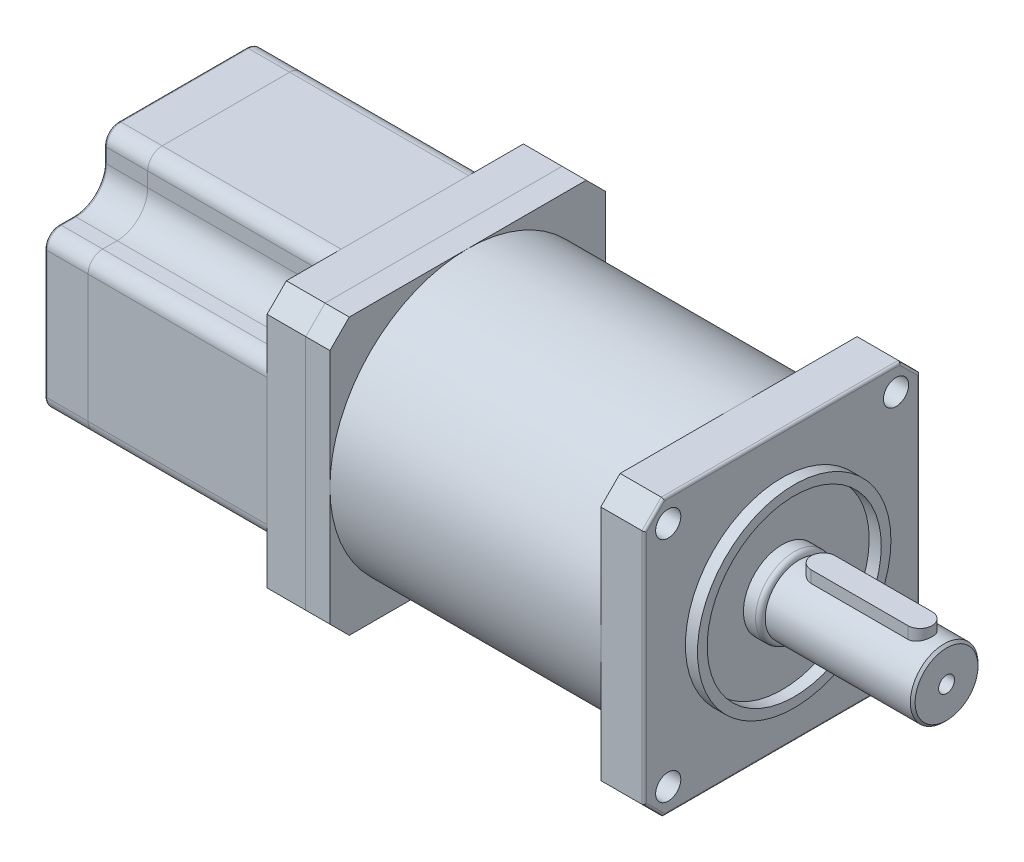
from build123d import *

# Parameters (mm, degrees)
EXTRUDE_1_DEPTH     = 9
SKETCH_2_R          = 28.5
EXTRUDE_2_DEPTH     = 56
EXTRUDE_3_DEPTH     = 5
EXTRUDE_4_DEPTH     = 8
EXTRUDE_5_DEPTH     = 37
EXTRUDE_6_DEPTH     = 9
CUT_EXTRUDE_1_DEPTH = 46
FILLET_1_R          = 0.5
FILLET_2_R          = 0.5
SKETCH_8_R          = 2.6
CUT_EXTRUDE_2_DEPTH = 9
SKETCH_9_R          = 20
SKETCH_9_R_2        = 18
EXTRUDE_7_DEPTH     = 2.5
SKETCH_10_R         = 8
EXTRUDE_8_DEPTH     = 3.5
FILLET_3_R          = 1
SKETCH_11_R         = 7
EXTRUDE_9_DEPTH     = 30.5
CUT_EXTRUDE_3_DEPTH = 3
EXTRUDE_10_DEPTH    = 5
CHAMFER_1_SIZE      = 0.5


with BuildPart() as part:
    # Sketch 1 → Extrude 1 (new body)
    with BuildSketch(Plane(origin=(0, 0, 0), x_dir=(0, 0, -1), z_dir=(1, 0, 0))):
        Polygon((-28.5, 24.5), (-24.5, 28.5), (24.5, 28.5), (28.5, 24.5), (28.5, -24.5), (24.5, -28.5), (-24.5, -28.5), (-28.5, -24.5), align=None)
    extrude(amount=-EXTRUDE_1_DEPTH)

    # Sketch 2 → Extrude 2 (add)
    with BuildSketch(Plane.ZY.offset(9)):
        Circle(SKETCH_2_R)
    extrude(amount=EXTRUDE_2_DEPTH)

    # Sketch 3 → Extrude 3 (add)
    with BuildSketch(Plane.ZY.offset(65)):
        Polygon((-24.5, -28.5), (24.5, -28.5), (28.5, -24.5), (28.5, 24.5), (24.5, 28.5), (-24.5, 28.5), (-28.5, 24.5), (-28.5, -24.5), align=None)
    extrude(amount=EXTRUDE_3_DEPTH)

    # Fillet 2
    fillet_2_edges = [part.edges().sort_by_distance(p)[0] for p in [
        (0, 26.5, 26.5),
        (0, 28.5, 0),
        (0, 26.5, -26.5),
        (0, 0, -28.5),
        (0, -26.5, -26.5),
        (0, -28.5, 0),
        (0, -26.5, 26.5),
        (0, 0, 28.5),
    ]]
    fillet(fillet_2_edges, radius=FILLET_2_R)

    # Sketch 8 → Cut-Extrude 2 (cut)
    with BuildSketch(Plane(origin=(0, 0, 0), x_dir=(0, 0, -1), z_dir=(1, 0, 0))):
        with Locations((-23.55, 23.55)):
            Circle(SKETCH_8_R)
        with Locations((23.55, 23.55)):
            Circle(SKETCH_8_R)
        with Locations((23.55, -23.55)):
            Circle(SKETCH_8_R)
        with Locations((-23.55, -23.55)):
            Circle(SKETCH_8_R)
    extrude(amount=-CUT_EXTRUDE_2_DEPTH, mode=Mode.SUBTRACT)

    # Sketch 9 → Extrude 7 (add)
    with BuildSketch(Plane(origin=(0, 0, 0), x_dir=(0, 0, -1), z_dir=(1, 0, 0))):
        Circle(SKETCH_9_R)
        Circle(SKETCH_9_R_2, mode=Mode.SUBTRACT)
    extrude(amount=EXTRUDE_7_DEPTH)

    # Sketch 10 → Extrude 8 (add)
    with BuildSketch(Plane(origin=(0, 0, 0), x_dir=(0, 0, -1), z_dir=(1, 0, 0))):
        Circle(SKETCH_10_R)
    extrude(amount=EXTRUDE_8_DEPTH)

    # Fillet 3
    fillet_3_edges = [part.edges().sort_by_distance(p)[0] for p in [
        (3.5, 0, 8),
    ]]
    fillet(fillet_3_edges, radius=FILLET_3_R)


with BuildPart() as body_2:
    # Sketch 4 → Extrude 4 (new body)
    with BuildSketch(Plane.ZY.offset(70)):
        Polygon((-24.5, -28.5), (24.5, -28.5), (28.5, -24.5), (28.5, 24.5), (24.5, 28.5), (-24.5, 28.5), (-28.5, 24.5), (-28.5, -24.5), align=None)
    extrude(amount=EXTRUDE_4_DEPTH)


with BuildPart() as body_3:
    # Sketch 5 → Extrude 5 (new body)
    with BuildSketch(Plane.ZY.offset(78)):
        Polygon((-24.5, -28.5), (24.5, -28.5), (28.5, -24.5), (28.5, 24.5), (24.5, 28.5), (-24.5, 28.5), (-28.5, 24.5), (-28.5, -24.5), align=None)
    extrude(amount=EXTRUDE_5_DEPTH)


with BuildPart() as body_4:
    # Sketch 6 → Extrude 6 (new body)
    with BuildSketch(Plane.ZY.offset(115)):
        Polygon((-24.5, -28.5), (24.5, -28.5), (28.5, -24.5), (28.5, 24.5), (24.5, 28.5), (-24.5, 28.5), (-28.5, 24.5), (-28.5, -24.5), align=None)
    extrude(amount=EXTRUDE_6_DEPTH)


with BuildPart() as cut_extrude_1_tool:
    # Sketch 7 → Cut-Extrude 1 (new body)
    with BuildSketch(Plane.ZY.offset(124)):
        with BuildLine():
            Line((-22.5, 16.17544468), (-25.5, 16.17544468))
            ThreePointArc((-25.5, 16.17544468), (-27.621320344, 15.296765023), (-28.5, 13.17544468))
            Line((-28.5, 13.17544468), (-28.5, 24.5))
            Line((-28.5, 24.5), (-24.5, 28.5))
            Line((-24.5, 28.5), (-13.17544468, 28.5))
            ThreePointArc((-13.17544468, 28.5), (-15.296765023, 27.621320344), (-16.17544468, 25.5))
            Line((-16.17544468, 25.5), (-16.17544468, 22.5))
            ThreePointArc((-16.17544468, 22.5), (-18.027864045, 18.027864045), (-22.5, 16.17544468))
        make_face()
        with BuildLine():
            Line((13.17544468, 28.5), (24.5, 28.5))
            Line((24.5, 28.5), (28.5, 24.5))
            Line((28.5, 24.5), (28.5, 13.17544468))
            ThreePointArc((28.5, 13.17544468), (27.621320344, 15.296765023), (25.5, 16.17544468))
            Line((25.5, 16.17544468), (22.5, 16.17544468))
            ThreePointArc((22.5, 16.17544468), (18.027864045, 18.027864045), (16.17544468, 22.5))
            Line((16.17544468, 22.5), (16.17544468, 25.5))
            ThreePointArc((16.17544468, 25.5), (15.296765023, 27.621320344), (13.17544468, 28.5))
        make_face()
        with BuildLine():
            Line((-25.5, -16.17544468), (-22.5, -16.17544468))
            ThreePointArc((-22.5, -16.17544468), (-18.027864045, -18.027864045), (-16.17544468, -22.5))
            Line((-16.17544468, -22.5), (-16.17544468, -25.5))
            ThreePointArc((-16.17544468, -25.5), (-15.296765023, -27.621320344), (-13.17544468, -28.5))
            Line((-13.17544468, -28.5), (-24.5, -28.5))
            Line((-24.5, -28.5), (-28.5, -24.5))
            Line((-28.5, -24.5), (-28.5, -13.17544468))
            ThreePointArc((-28.5, -13.17544468), (-27.621320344, -15.296765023), (-25.5, -16.17544468))
        make_face()
        with BuildLine():
            Line((28.5, -13.17544468), (28.5, -24.5))
            Line((28.5, -24.5), (24.5, -28.5))
            Line((24.5, -28.5), (13.17544468, -28.5))
            ThreePointArc((13.17544468, -28.5), (15.296765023, -27.621320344), (16.17544468, -25.5))
            Line((16.17544468, -25.5), (16.17544468, -22.5))
            ThreePointArc((16.17544468, -22.5), (18.027864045, -18.027864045), (22.5, -16.17544468))
            Line((22.5, -16.17544468), (25.5, -16.17544468))
            ThreePointArc((25.5, -16.17544468), (27.621320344, -15.296765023), (28.5, -13.17544468))
        make_face()
    extrude(amount=-CUT_EXTRUDE_1_DEPTH)


with BuildPart() as body_3_1:
    add(body_3.part)

    # Cut-Extrude 1: cut by cut_extrude_1_tool
    add(cut_extrude_1_tool.part, mode=Mode.SUBTRACT)


with BuildPart() as body_4_1:
    add(body_4.part)

    # Cut-Extrude 1: cut by cut_extrude_1_tool
    add(cut_extrude_1_tool.part, mode=Mode.SUBTRACT)

    # Fillet 1
    fillet_1_edges = [body_4_1.edges().sort_by_distance(p)[0] for p in [
        (-124, 18.027864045, 18.027864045),
        (-124, 16.17544468, 24),
        (-124, 15.296765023, 27.621320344),
        (-124, 27.621320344, 15.296765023),
        (-124, 24, 16.17544468),
        (-124, 0, -28.5),
        (-124, -28.5, 0),
        (-124, 0, 28.5),
        (-124, 28.5, 0),
        (-124, 27.621320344, -15.296765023),
        (-124, 15.296765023, -27.621320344),
        (-124, 16.17544468, -24),
        (-124, 18.027864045, -18.027864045),
        (-124, 24, -16.17544468),
        (-124, -18.027864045, -18.027864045),
        (-124, -16.17544468, -24),
        (-124, -15.296765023, -27.621320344),
        (-124, -27.621320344, -15.296765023),
        (-124, -24, -16.17544468),
        (-124, -18.027864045, 18.027864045),
        (-124, -24, 16.17544468),
        (-124, -27.621320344, 15.296765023),
        (-124, -15.296765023, 27.621320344),
        (-124, -16.17544468, 24),
    ]]
    fillet(fillet_1_edges, radius=FILLET_1_R)


with BuildPart() as body_5:
    # Sketch 11 → Extrude 9 (new body)
    with BuildSketch(Plane(origin=(3.5, 0, 0), x_dir=(0, 0, -1), z_dir=(1, 0, 0))):
        with Locations(Location((0, 0, 0), (0, 0, 180))):
            Circle(SKETCH_11_R)
    extrude(amount=EXTRUDE_9_DEPTH)

    # Sketch 12 → Cut-Extrude 3 (cut)
    with BuildSketch(Plane(origin=(0, 7, 0), x_dir=(1, 0, 0), z_dir=(0, 1, 0))):
        with BuildLine():
            Line((8.5, 2.5), (28.5, 2.5))
            ThreePointArc((28.5, 2.5), (31, 0), (28.5, -2.5))
            Line((28.5, -2.5), (8.5, -2.5))
            ThreePointArc((8.5, -2.5), (6, 0), (8.5, 2.5))
        make_face()
    extrude(amount=-CUT_EXTRUDE_3_DEPTH, mode=Mode.SUBTRACT)

    # Chamfer 1
    chamfer_1_edges = [body_5.edges().sort_by_distance(p)[0] for p in [
        (34, 0, -7),
    ]]
    chamfer(chamfer_1_edges, length=CHAMFER_1_SIZE)

    # Sketch 16 → Hole Wizard M4 _1 (revolve, cut)
    with BuildSketch(Plane(origin=(34, 0, 0), x_dir=(0, 0, -1), z_dir=(0, 1, 0))):
        Polygon((0, 0), (0, 10.491420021), (1.65, 9.5), (1.65, 0), align=None)
    revolve(axis=Axis((40.35, 0, 0), (-1, 0, 0)), mode=Mode.SUBTRACT)


with BuildPart() as body_6:
    # Sketch 13 → Extrude 10 (new body)
    with BuildSketch(Plane(origin=(0, 4, 0), x_dir=(1, 0, 0), z_dir=(0, 1, 0))):
        with BuildLine():
            Line((28.5, 2.5), (8.5, 2.5))
            ThreePointArc((8.5, 2.5), (6, 0), (8.5, -2.5))
            Line((8.5, -2.5), (28.5, -2.5))
            ThreePointArc((28.5, -2.5), (31, 0), (28.5, 2.5))
        make_face()
    extrude(amount=EXTRUDE_10_DEPTH)


solid = Compound([part.part, body_2.part, body_3_1.part, body_4_1.part, body_5.part, body_6.part])
